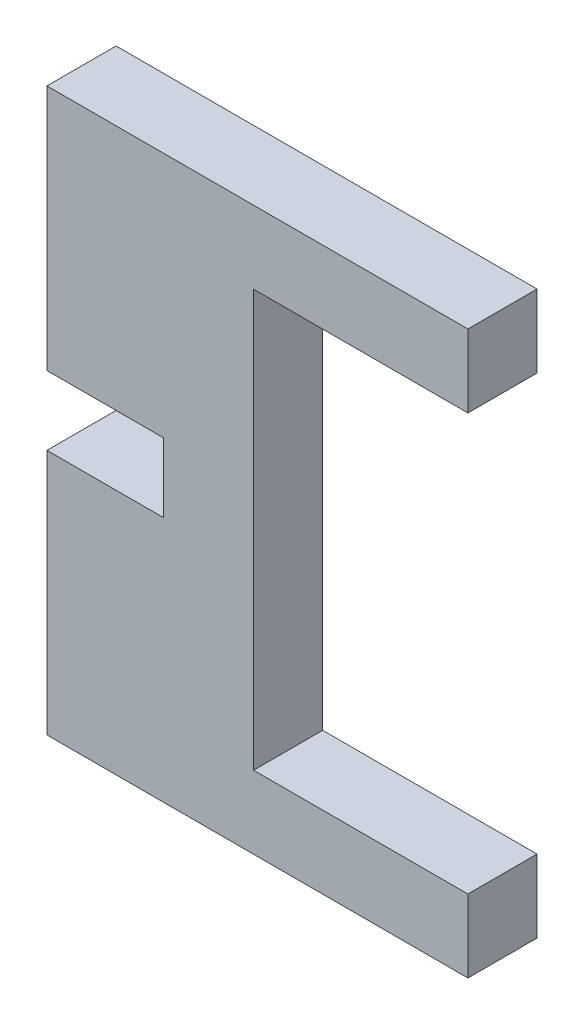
ISO-10303-21;
HEADER;
FILE_DESCRIPTION(('STEP AP214'),'2;1');
FILE_NAME('part.step','',(''),(''),'','','');
FILE_SCHEMA(('AUTOMOTIVE_DESIGN { 1 0 10303 214 1 1 1 1 }'));
ENDSEC;
DATA;
#1=APPLICATION_CONTEXT('core data for automotive mechanical design processes');
#2=APPLICATION_PROTOCOL_DEFINITION('international standard','automotive_design',2000,#1);
#3=PRODUCT_CONTEXT('',#1,'mechanical');
#4=PRODUCT('Part','Part','',(#3));
#5=PRODUCT_RELATED_PRODUCT_CATEGORY('part','',(#4));
#6=PRODUCT_DEFINITION_FORMATION('','',#4);
#7=PRODUCT_DEFINITION_CONTEXT('part definition',#1,'design');
#8=PRODUCT_DEFINITION('design','',#6,#7);
#9=PRODUCT_DEFINITION_SHAPE('','',#8);
#10=(LENGTH_UNIT() NAMED_UNIT(*) SI_UNIT(.MILLI.,.METRE.));
#11=(NAMED_UNIT(*) PLANE_ANGLE_UNIT() SI_UNIT($,.RADIAN.));
#12=(NAMED_UNIT(*) SI_UNIT($,.STERADIAN.) SOLID_ANGLE_UNIT());
#13=UNCERTAINTY_MEASURE_WITH_UNIT(LENGTH_MEASURE(1.E-05),#10,'distance_accuracy_value','');
#14=(GEOMETRIC_REPRESENTATION_CONTEXT(3) GLOBAL_UNCERTAINTY_ASSIGNED_CONTEXT((#13)) GLOBAL_UNIT_ASSIGNED_CONTEXT((#10,
#11,#12)) REPRESENTATION_CONTEXT('',''));
#15=CARTESIAN_POINT('',(0.,0.,0.));
#16=DIRECTION('',(0.,0.,1.));
#17=DIRECTION('',(1.,0.,0.));
#18=AXIS2_PLACEMENT_3D('',#15,#16,#17);
#19=CARTESIAN_POINT('',(0.,-2.921,5.842));
#20=DIRECTION('',(0.,-1.,0.));
#21=DIRECTION('',(1.,0.,0.));
#22=AXIS2_PLACEMENT_3D('',#19,#20,#21);
#23=PLANE('',#22);
#24=DIRECTION('',(-1.,0.,0.));
#25=VECTOR('',#24,1.);
#26=CARTESIAN_POINT('',(0.,-2.921,0.));
#27=LINE('',#26,#25);
#28=CARTESIAN_POINT('',(0.,-2.921,0.));
#29=VERTEX_POINT('',#28);
#30=CARTESIAN_POINT('',(-9.83762517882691,-2.921,0.));
#31=VERTEX_POINT('',#30);
#32=EDGE_CURVE('E123',#29,#31,#27,.T.);
#33=ORIENTED_EDGE('',*,*,#32,.T.);
#34=DIRECTION('',(0.,0.,-1.));
#35=VECTOR('',#34,1.);
#36=CARTESIAN_POINT('',(-9.83762517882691,-2.921,5.842));
#37=LINE('',#36,#35);
#38=CARTESIAN_POINT('',(-9.83762517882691,-2.921,5.842));
#39=VERTEX_POINT('',#38);
#40=EDGE_CURVE('E11',#39,#31,#37,.T.);
#41=ORIENTED_EDGE('',*,*,#40,.F.);
#42=DIRECTION('',(-1.,0.,0.));
#43=VECTOR('',#42,1.);
#44=CARTESIAN_POINT('',(0.,-2.921,5.842));
#45=LINE('',#44,#43);
#46=CARTESIAN_POINT('',(0.,-2.921,5.842));
#47=VERTEX_POINT('',#46);
#48=EDGE_CURVE('E158',#47,#39,#45,.T.);
#49=ORIENTED_EDGE('',*,*,#48,.F.);
#50=DIRECTION('',(0.,0.,-1.));
#51=VECTOR('',#50,1.);
#52=CARTESIAN_POINT('',(0.,-2.921,5.842));
#53=LINE('',#52,#51);
#54=EDGE_CURVE('E136',#47,#29,#53,.T.);
#55=ORIENTED_EDGE('',*,*,#54,.T.);
#56=EDGE_LOOP('',(#33,#41,#49,#55));
#57=FACE_BOUND('',#56,.T.);
#58=ADVANCED_FACE('F31',(#57),#23,.F.);
#59=CARTESIAN_POINT('',(-9.83762517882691,-2.921,5.842));
#60=DIRECTION('',(1.,0.,0.));
#61=DIRECTION('',(0.,1.,0.));
#62=AXIS2_PLACEMENT_3D('',#59,#60,#61);
#63=PLANE('',#62);
#64=DIRECTION('',(0.,-1.,0.));
#65=VECTOR('',#64,1.);
#66=CARTESIAN_POINT('',(-9.83762517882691,-2.921,0.));
#67=LINE('',#66,#65);
#68=CARTESIAN_POINT('',(-9.8376251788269,-23.7494183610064,0.));
#69=VERTEX_POINT('',#68);
#70=EDGE_CURVE('E119',#31,#69,#67,.T.);
#71=ORIENTED_EDGE('',*,*,#70,.T.);
#72=DIRECTION('',(0.,0.,-1.));
#73=VECTOR('',#72,1.);
#74=CARTESIAN_POINT('',(-9.8376251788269,-23.7494183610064,5.842));
#75=LINE('',#74,#73);
#76=CARTESIAN_POINT('',(-9.8376251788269,-23.7494183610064,5.842));
#77=VERTEX_POINT('',#76);
#78=EDGE_CURVE('E38',#77,#69,#75,.T.);
#79=ORIENTED_EDGE('',*,*,#78,.F.);
#80=DIRECTION('',(0.,-1.,0.));
#81=VECTOR('',#80,1.);
#82=CARTESIAN_POINT('',(-9.83762517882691,-2.921,5.842));
#83=LINE('',#82,#81);
#84=EDGE_CURVE('E132',#39,#77,#83,.T.);
#85=ORIENTED_EDGE('',*,*,#84,.F.);
#86=ORIENTED_EDGE('',*,*,#40,.T.);
#87=EDGE_LOOP('',(#71,#79,#85,#86));
#88=FACE_BOUND('',#87,.T.);
#89=ADVANCED_FACE('F131',(#88),#63,.F.);
#90=CARTESIAN_POINT('',(-9.8376251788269,-23.7494183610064,5.842));
#91=DIRECTION('',(0.,1.,0.));
#92=DIRECTION('',(0.,0.,1.));
#93=AXIS2_PLACEMENT_3D('',#90,#91,#92);
#94=PLANE('',#93);
#95=DIRECTION('',(1.,0.,0.));
#96=VECTOR('',#95,1.);
#97=CARTESIAN_POINT('',(-9.8376251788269,-23.7494183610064,0.));
#98=LINE('',#97,#96);
#99=CARTESIAN_POINT('',(25.736817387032,-23.7494183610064,0.));
#100=VERTEX_POINT('',#99);
#101=EDGE_CURVE('E125',#69,#100,#98,.T.);
#102=ORIENTED_EDGE('',*,*,#101,.T.);
#103=DIRECTION('',(0.,0.,-1.));
#104=VECTOR('',#103,1.);
#105=CARTESIAN_POINT('',(25.736817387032,-23.7494183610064,5.842));
#106=LINE('',#105,#104);
#107=CARTESIAN_POINT('',(25.736817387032,-23.7494183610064,5.842));
#108=VERTEX_POINT('',#107);
#109=EDGE_CURVE('E204',#108,#100,#106,.T.);
#110=ORIENTED_EDGE('',*,*,#109,.F.);
#111=DIRECTION('',(1.,0.,0.));
#112=VECTOR('',#111,1.);
#113=CARTESIAN_POINT('',(-9.8376251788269,-23.7494183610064,5.842));
#114=LINE('',#113,#112);
#115=EDGE_CURVE('E161',#77,#108,#114,.T.);
#116=ORIENTED_EDGE('',*,*,#115,.F.);
#117=ORIENTED_EDGE('',*,*,#78,.T.);
#118=EDGE_LOOP('',(#102,#110,#116,#117));
#119=FACE_BOUND('',#118,.T.);
#120=ADVANCED_FACE('F208',(#119),#94,.F.);
#121=CARTESIAN_POINT('',(25.736817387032,-23.7494183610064,5.842));
#122=DIRECTION('',(-1.,0.,0.));
#123=DIRECTION('',(0.,0.,1.));
#124=AXIS2_PLACEMENT_3D('',#121,#122,#123);
#125=PLANE('',#124);
#126=DIRECTION('',(0.,1.,0.));
#127=VECTOR('',#126,1.);
#128=CARTESIAN_POINT('',(25.736817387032,-23.7494183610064,0.));
#129=LINE('',#128,#127);
#130=CARTESIAN_POINT('',(25.736817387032,-17.6022,0.));
#131=VERTEX_POINT('',#130);
#132=EDGE_CURVE('E140',#100,#131,#129,.T.);
#133=ORIENTED_EDGE('',*,*,#132,.T.);
#134=DIRECTION('',(0.,0.,-1.));
#135=VECTOR('',#134,1.);
#136=CARTESIAN_POINT('',(25.736817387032,-17.6022,5.842));
#137=LINE('',#136,#135);
#138=CARTESIAN_POINT('',(25.736817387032,-17.6022,5.842));
#139=VERTEX_POINT('',#138);
#140=EDGE_CURVE('E201',#139,#131,#137,.T.);
#141=ORIENTED_EDGE('',*,*,#140,.F.);
#142=DIRECTION('',(0.,1.,0.));
#143=VECTOR('',#142,1.);
#144=CARTESIAN_POINT('',(25.736817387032,-23.7494183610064,5.842));
#145=LINE('',#144,#143);
#146=EDGE_CURVE('E163',#108,#139,#145,.T.);
#147=ORIENTED_EDGE('',*,*,#146,.F.);
#148=ORIENTED_EDGE('',*,*,#109,.T.);
#149=EDGE_LOOP('',(#133,#141,#147,#148));
#150=FACE_BOUND('',#149,.T.);
#151=ADVANCED_FACE('F216',(#150),#125,.F.);
#152=CARTESIAN_POINT('',(25.736817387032,-17.6022,5.842));
#153=DIRECTION('',(0.,-1.,0.));
#154=DIRECTION('',(0.,0.,-1.));
#155=AXIS2_PLACEMENT_3D('',#152,#153,#154);
#156=PLANE('',#155);
#157=DIRECTION('',(-1.,0.,0.));
#158=VECTOR('',#157,1.);
#159=CARTESIAN_POINT('',(25.736817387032,-17.6022,0.));
#160=LINE('',#159,#158);
#161=CARTESIAN_POINT('',(7.62,-17.6022,0.));
#162=VERTEX_POINT('',#161);
#163=EDGE_CURVE('E142',#131,#162,#160,.T.);
#164=ORIENTED_EDGE('',*,*,#163,.T.);
#165=DIRECTION('',(0.,0.,-1.));
#166=VECTOR('',#165,1.);
#167=CARTESIAN_POINT('',(7.62,-17.6022,5.842));
#168=LINE('',#167,#166);
#169=CARTESIAN_POINT('',(7.62,-17.6022,5.842));
#170=VERTEX_POINT('',#169);
#171=EDGE_CURVE('E198',#170,#162,#168,.T.);
#172=ORIENTED_EDGE('',*,*,#171,.F.);
#173=DIRECTION('',(-1.,0.,0.));
#174=VECTOR('',#173,1.);
#175=CARTESIAN_POINT('',(25.736817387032,-17.6022,5.842));
#176=LINE('',#175,#174);
#177=EDGE_CURVE('E165',#139,#170,#176,.T.);
#178=ORIENTED_EDGE('',*,*,#177,.F.);
#179=ORIENTED_EDGE('',*,*,#140,.T.);
#180=EDGE_LOOP('',(#164,#172,#178,#179));
#181=FACE_BOUND('',#180,.T.);
#182=ADVANCED_FACE('F219',(#181),#156,.F.);
#183=CARTESIAN_POINT('',(7.62,-17.6022,5.842));
#184=DIRECTION('',(-1.,0.,0.));
#185=DIRECTION('',(0.,0.,1.));
#186=AXIS2_PLACEMENT_3D('',#183,#184,#185);
#187=PLANE('',#186);
#188=DIRECTION('',(0.,1.,0.));
#189=VECTOR('',#188,1.);
#190=CARTESIAN_POINT('',(7.62,-17.6022,0.));
#191=LINE('',#190,#189);
#192=CARTESIAN_POINT('',(7.62,17.6022,0.));
#193=VERTEX_POINT('',#192);
#194=EDGE_CURVE('E144',#162,#193,#191,.T.);
#195=ORIENTED_EDGE('',*,*,#194,.T.);
#196=DIRECTION('',(0.,0.,-1.));
#197=VECTOR('',#196,1.);
#198=CARTESIAN_POINT('',(7.62,17.6022,5.842));
#199=LINE('',#198,#197);
#200=CARTESIAN_POINT('',(7.62,17.6022,5.842));
#201=VERTEX_POINT('',#200);
#202=EDGE_CURVE('E195',#201,#193,#199,.T.);
#203=ORIENTED_EDGE('',*,*,#202,.F.);
#204=DIRECTION('',(0.,1.,0.));
#205=VECTOR('',#204,1.);
#206=CARTESIAN_POINT('',(7.62,-17.6022,5.842));
#207=LINE('',#206,#205);
#208=EDGE_CURVE('E167',#170,#201,#207,.T.);
#209=ORIENTED_EDGE('',*,*,#208,.F.);
#210=ORIENTED_EDGE('',*,*,#171,.T.);
#211=EDGE_LOOP('',(#195,#203,#209,#210));
#212=FACE_BOUND('',#211,.T.);
#213=ADVANCED_FACE('F224',(#212),#187,.F.);
#214=CARTESIAN_POINT('',(25.736817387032,17.6022,5.842));
#215=DIRECTION('',(0.,1.,0.));
#216=DIRECTION('',(0.,0.,1.));
#217=AXIS2_PLACEMENT_3D('',#214,#215,#216);
#218=PLANE('',#217);
#219=DIRECTION('',(1.,0.,0.));
#220=VECTOR('',#219,1.);
#221=CARTESIAN_POINT('',(25.736817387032,17.6022,0.));
#222=LINE('',#221,#220);
#223=CARTESIAN_POINT('',(25.736817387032,17.6022,0.));
#224=VERTEX_POINT('',#223);
#225=EDGE_CURVE('E146',#193,#224,#222,.T.);
#226=ORIENTED_EDGE('',*,*,#225,.T.);
#227=DIRECTION('',(0.,0.,-1.));
#228=VECTOR('',#227,1.);
#229=CARTESIAN_POINT('',(25.736817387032,17.6022,5.842));
#230=LINE('',#229,#228);
#231=CARTESIAN_POINT('',(25.736817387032,17.6022,5.842));
#232=VERTEX_POINT('',#231);
#233=EDGE_CURVE('E192',#232,#224,#230,.T.);
#234=ORIENTED_EDGE('',*,*,#233,.F.);
#235=DIRECTION('',(1.,0.,0.));
#236=VECTOR('',#235,1.);
#237=CARTESIAN_POINT('',(25.736817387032,17.6022,5.842));
#238=LINE('',#237,#236);
#239=EDGE_CURVE('E169',#201,#232,#238,.T.);
#240=ORIENTED_EDGE('',*,*,#239,.F.);
#241=ORIENTED_EDGE('',*,*,#202,.T.);
#242=EDGE_LOOP('',(#226,#234,#240,#241));
#243=FACE_BOUND('',#242,.T.);
#244=ADVANCED_FACE('F230',(#243),#218,.F.);
#245=CARTESIAN_POINT('',(25.736817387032,23.7494183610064,5.842));
#246=DIRECTION('',(-1.,0.,0.));
#247=DIRECTION('',(0.,0.,1.));
#248=AXIS2_PLACEMENT_3D('',#245,#246,#247);
#249=PLANE('',#248);
#250=DIRECTION('',(0.,1.,0.));
#251=VECTOR('',#250,1.);
#252=CARTESIAN_POINT('',(25.736817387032,23.7494183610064,0.));
#253=LINE('',#252,#251);
#254=CARTESIAN_POINT('',(25.736817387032,23.7494183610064,0.));
#255=VERTEX_POINT('',#254);
#256=EDGE_CURVE('E148',#224,#255,#253,.T.);
#257=ORIENTED_EDGE('',*,*,#256,.T.);
#258=DIRECTION('',(0.,0.,-1.));
#259=VECTOR('',#258,1.);
#260=CARTESIAN_POINT('',(25.736817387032,23.7494183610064,5.842));
#261=LINE('',#260,#259);
#262=CARTESIAN_POINT('',(25.736817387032,23.7494183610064,5.842));
#263=VERTEX_POINT('',#262);
#264=EDGE_CURVE('E189',#263,#255,#261,.T.);
#265=ORIENTED_EDGE('',*,*,#264,.F.);
#266=DIRECTION('',(0.,1.,0.));
#267=VECTOR('',#266,1.);
#268=CARTESIAN_POINT('',(25.736817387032,23.7494183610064,5.842));
#269=LINE('',#268,#267);
#270=EDGE_CURVE('E171',#232,#263,#269,.T.);
#271=ORIENTED_EDGE('',*,*,#270,.F.);
#272=ORIENTED_EDGE('',*,*,#233,.T.);
#273=EDGE_LOOP('',(#257,#265,#271,#272));
#274=FACE_BOUND('',#273,.T.);
#275=ADVANCED_FACE('F234',(#274),#249,.F.);
#276=CARTESIAN_POINT('',(-9.8376251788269,23.7494183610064,5.842));
#277=DIRECTION('',(0.,-1.,0.));
#278=DIRECTION('',(0.,0.,-1.));
#279=AXIS2_PLACEMENT_3D('',#276,#277,#278);
#280=PLANE('',#279);
#281=DIRECTION('',(-1.,0.,0.));
#282=VECTOR('',#281,1.);
#283=CARTESIAN_POINT('',(-9.8376251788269,23.7494183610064,0.));
#284=LINE('',#283,#282);
#285=CARTESIAN_POINT('',(-9.8376251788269,23.7494183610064,0.));
#286=VERTEX_POINT('',#285);
#287=EDGE_CURVE('E150',#255,#286,#284,.T.);
#288=ORIENTED_EDGE('',*,*,#287,.T.);
#289=DIRECTION('',(0.,0.,-1.));
#290=VECTOR('',#289,1.);
#291=CARTESIAN_POINT('',(-9.8376251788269,23.7494183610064,5.842));
#292=LINE('',#291,#290);
#293=CARTESIAN_POINT('',(-9.8376251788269,23.7494183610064,5.842));
#294=VERTEX_POINT('',#293);
#295=EDGE_CURVE('E186',#294,#286,#292,.T.);
#296=ORIENTED_EDGE('',*,*,#295,.F.);
#297=DIRECTION('',(-1.,0.,0.));
#298=VECTOR('',#297,1.);
#299=CARTESIAN_POINT('',(-9.8376251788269,23.7494183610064,5.842));
#300=LINE('',#299,#298);
#301=EDGE_CURVE('E173',#263,#294,#300,.T.);
#302=ORIENTED_EDGE('',*,*,#301,.F.);
#303=ORIENTED_EDGE('',*,*,#264,.T.);
#304=EDGE_LOOP('',(#288,#296,#302,#303));
#305=FACE_BOUND('',#304,.T.);
#306=ADVANCED_FACE('F239',(#305),#280,.F.);
#307=CARTESIAN_POINT('',(-9.83762517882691,2.921,5.842));
#308=DIRECTION('',(1.,0.,0.));
#309=DIRECTION('',(0.,1.,0.));
#310=AXIS2_PLACEMENT_3D('',#307,#308,#309);
#311=PLANE('',#310);
#312=DIRECTION('',(0.,-1.,0.));
#313=VECTOR('',#312,1.);
#314=CARTESIAN_POINT('',(-9.83762517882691,2.921,0.));
#315=LINE('',#314,#313);
#316=CARTESIAN_POINT('',(-9.83762517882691,2.921,0.));
#317=VERTEX_POINT('',#316);
#318=EDGE_CURVE('E152',#286,#317,#315,.T.);
#319=ORIENTED_EDGE('',*,*,#318,.T.);
#320=DIRECTION('',(0.,0.,-1.));
#321=VECTOR('',#320,1.);
#322=CARTESIAN_POINT('',(-9.83762517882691,2.921,5.842));
#323=LINE('',#322,#321);
#324=CARTESIAN_POINT('',(-9.83762517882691,2.921,5.842));
#325=VERTEX_POINT('',#324);
#326=EDGE_CURVE('E183',#325,#317,#323,.T.);
#327=ORIENTED_EDGE('',*,*,#326,.F.);
#328=DIRECTION('',(0.,-1.,0.));
#329=VECTOR('',#328,1.);
#330=CARTESIAN_POINT('',(-9.83762517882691,2.921,5.842));
#331=LINE('',#330,#329);
#332=EDGE_CURVE('E175',#294,#325,#331,.T.);
#333=ORIENTED_EDGE('',*,*,#332,.F.);
#334=ORIENTED_EDGE('',*,*,#295,.T.);
#335=EDGE_LOOP('',(#319,#327,#333,#334));
#336=FACE_BOUND('',#335,.T.);
#337=ADVANCED_FACE('F243',(#336),#311,.F.);
#338=CARTESIAN_POINT('',(0.,2.921,5.842));
#339=DIRECTION('',(0.,1.,0.));
#340=DIRECTION('',(-1.,0.,0.));
#341=AXIS2_PLACEMENT_3D('',#338,#339,#340);
#342=PLANE('',#341);
#343=DIRECTION('',(1.,0.,0.));
#344=VECTOR('',#343,1.);
#345=CARTESIAN_POINT('',(0.,2.921,0.));
#346=LINE('',#345,#344);
#347=CARTESIAN_POINT('',(0.,2.921,0.));
#348=VERTEX_POINT('',#347);
#349=EDGE_CURVE('E154',#317,#348,#346,.T.);
#350=ORIENTED_EDGE('',*,*,#349,.T.);
#351=DIRECTION('',(0.,0.,-1.));
#352=VECTOR('',#351,1.);
#353=CARTESIAN_POINT('',(0.,2.921,5.842));
#354=LINE('',#353,#352);
#355=CARTESIAN_POINT('',(0.,2.921,5.842));
#356=VERTEX_POINT('',#355);
#357=EDGE_CURVE('E180',#356,#348,#354,.T.);
#358=ORIENTED_EDGE('',*,*,#357,.F.);
#359=DIRECTION('',(1.,0.,0.));
#360=VECTOR('',#359,1.);
#361=CARTESIAN_POINT('',(0.,2.921,5.842));
#362=LINE('',#361,#360);
#363=EDGE_CURVE('E50',#325,#356,#362,.T.);
#364=ORIENTED_EDGE('',*,*,#363,.F.);
#365=ORIENTED_EDGE('',*,*,#326,.T.);
#366=EDGE_LOOP('',(#350,#358,#364,#365));
#367=FACE_BOUND('',#366,.T.);
#368=ADVANCED_FACE('F247',(#367),#342,.F.);
#369=CARTESIAN_POINT('',(0.,2.921,5.842));
#370=DIRECTION('',(1.,0.,0.));
#371=DIRECTION('',(0.,0.,-1.));
#372=AXIS2_PLACEMENT_3D('',#369,#370,#371);
#373=PLANE('',#372);
#374=DIRECTION('',(0.,-1.,0.));
#375=VECTOR('',#374,1.);
#376=CARTESIAN_POINT('',(0.,2.921,0.));
#377=LINE('',#376,#375);
#378=EDGE_CURVE('E156',#348,#29,#377,.T.);
#379=ORIENTED_EDGE('',*,*,#378,.T.);
#380=ORIENTED_EDGE('',*,*,#54,.F.);
#381=DIRECTION('',(0.,-1.,0.));
#382=VECTOR('',#381,1.);
#383=CARTESIAN_POINT('',(0.,2.921,5.842));
#384=LINE('',#383,#382);
#385=EDGE_CURVE('E45',#356,#47,#384,.T.);
#386=ORIENTED_EDGE('',*,*,#385,.F.);
#387=ORIENTED_EDGE('',*,*,#357,.T.);
#388=EDGE_LOOP('',(#379,#380,#386,#387));
#389=FACE_BOUND('',#388,.T.);
#390=ADVANCED_FACE('F249',(#389),#373,.F.);
#391=CARTESIAN_POINT('',(-9.83762517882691,-2.921,5.842));
#392=DIRECTION('',(0.,0.,1.));
#393=DIRECTION('',(1.,0.,0.));
#394=AXIS2_PLACEMENT_3D('',#391,#392,#393);
#395=PLANE('',#394);
#396=ORIENTED_EDGE('',*,*,#48,.T.);
#397=ORIENTED_EDGE('',*,*,#84,.T.);
#398=ORIENTED_EDGE('',*,*,#115,.T.);
#399=ORIENTED_EDGE('',*,*,#146,.T.);
#400=ORIENTED_EDGE('',*,*,#177,.T.);
#401=ORIENTED_EDGE('',*,*,#208,.T.);
#402=ORIENTED_EDGE('',*,*,#239,.T.);
#403=ORIENTED_EDGE('',*,*,#270,.T.);
#404=ORIENTED_EDGE('',*,*,#301,.T.);
#405=ORIENTED_EDGE('',*,*,#332,.T.);
#406=ORIENTED_EDGE('',*,*,#363,.T.);
#407=ORIENTED_EDGE('',*,*,#385,.T.);
#408=EDGE_LOOP('',(#396,#397,#398,#399,#400,#401,#402,#403,#404,#405,#406,#407));
#409=FACE_BOUND('',#408,.T.);
#410=ADVANCED_FACE('F211',(#409),#395,.T.);
#411=CARTESIAN_POINT('',(-9.83762517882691,-2.921,0.));
#412=DIRECTION('',(0.,0.,1.));
#413=DIRECTION('',(1.,0.,0.));
#414=AXIS2_PLACEMENT_3D('',#411,#412,#413);
#415=PLANE('',#414);
#416=ORIENTED_EDGE('',*,*,#32,.F.);
#417=ORIENTED_EDGE('',*,*,#378,.F.);
#418=ORIENTED_EDGE('',*,*,#349,.F.);
#419=ORIENTED_EDGE('',*,*,#318,.F.);
#420=ORIENTED_EDGE('',*,*,#287,.F.);
#421=ORIENTED_EDGE('',*,*,#256,.F.);
#422=ORIENTED_EDGE('',*,*,#225,.F.);
#423=ORIENTED_EDGE('',*,*,#194,.F.);
#424=ORIENTED_EDGE('',*,*,#163,.F.);
#425=ORIENTED_EDGE('',*,*,#132,.F.);
#426=ORIENTED_EDGE('',*,*,#101,.F.);
#427=ORIENTED_EDGE('',*,*,#70,.F.);
#428=EDGE_LOOP('',(#416,#417,#418,#419,#420,#421,#422,#423,#424,#425,#426,#427));
#429=FACE_BOUND('',#428,.T.);
#430=ADVANCED_FACE('F120',(#429),#415,.F.);
#431=CLOSED_SHELL('',(#58,#89,#120,#151,#182,#213,#244,#275,#306,#337,#368,#390,#410,#430));
#432=MANIFOLD_SOLID_BREP('B2',#431);
#433=ADVANCED_BREP_SHAPE_REPRESENTATION('',(#18,#432),#14);
#434=SHAPE_DEFINITION_REPRESENTATION(#9,#433);
ENDSEC;
END-ISO-10303-21;
